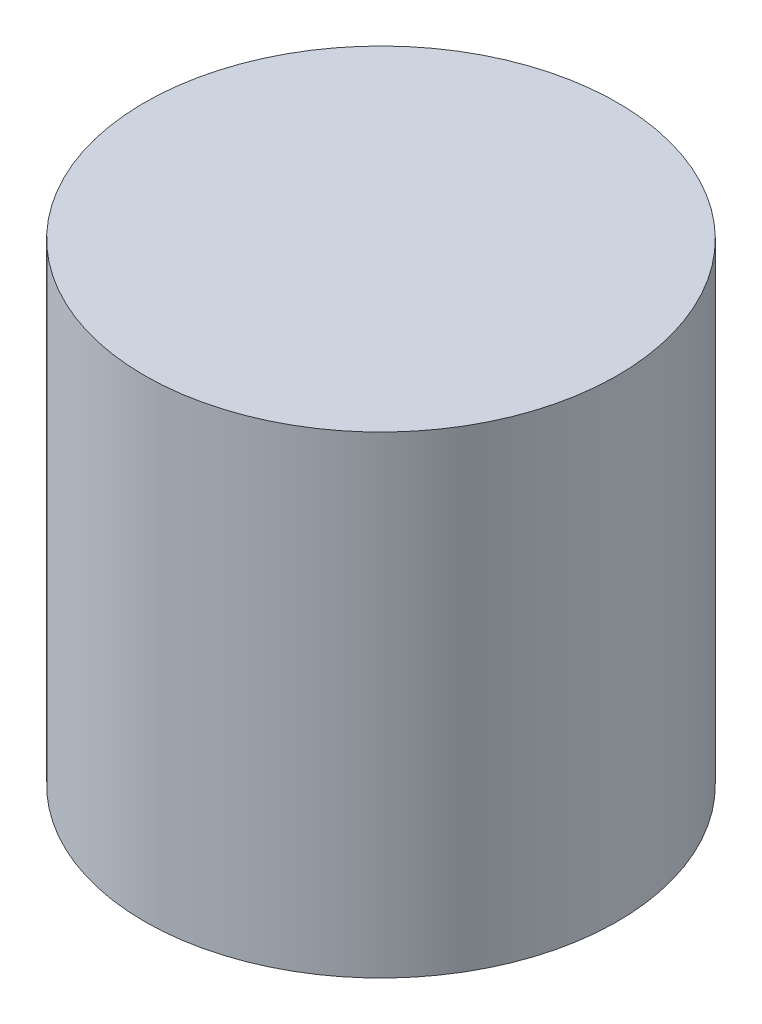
from build123d import *

# Parameters (mm, degrees)
SKETCH1_R           = 12.7
BOSS_EXTRUDE1_DEPTH = 25.4


with BuildPart() as part:
    # Sketch1 → Boss-Extrude1 (new body)
    with BuildSketch(Plane(origin=(0, 0, 0), x_dir=(1, 0, 0), z_dir=(0, 1, 0))):
        with Locations(Location((0, 0, 0), (0, 0, 270))):
            Circle(SKETCH1_R)
    extrude(amount=BOSS_EXTRUDE1_DEPTH)


solid = part.part
